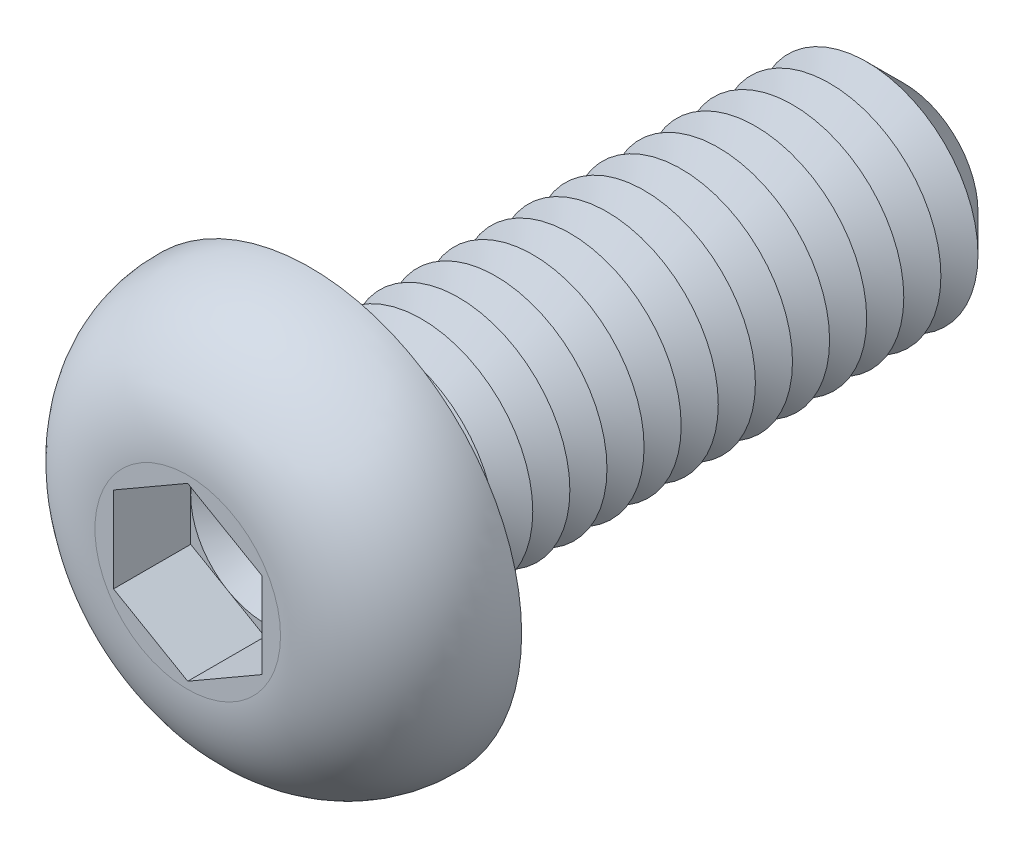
from build123d import *

# Parameters (mm, degrees)
CUT_EXTRUDE1_DEPTH  = 1.04
SKETCH4_R           = 1.5
BOSS_EXTRUDE1_DEPTH = 8
CHAMFER1_SIZE       = 0.5
LPATTERN1_COUNT     = 14
LPATTERN1_PITCH     = 0.5
FILLET2_R           = 0.2


with BuildPart() as part:
    # Sketch2 → Revolve1 (revolve)
    with BuildSketch(Plane(origin=(0, 0, 0), x_dir=(0, 0, -1), z_dir=(1, 0, 0)), mode=Mode.PRIVATE) as revolve1_sk:
        with BuildLine():
            Line((0, 0), (-1.65, 0))
            Line((-1.65, 0), (-1.65, 1.250781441))
            ThreePointArc((-1.65, 1.250781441), (-1.163552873, 2.39969397), (0, 2.85))
            Line((0, 2.85), (0, 0))
        make_face()
    revolve(revolve1_sk.sketch.rotate(Axis((0, 0, 47.934239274), (0, 0, -1)), 90), axis=Axis((0, 0, 47.934239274), (0, 0, -1)))

    # Sketch3 → Cut-Extrude1 (cut)
    with BuildSketch(Plane.XY.offset(1.65)):
        Polygon((0, 1.154700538), (-1, 0.577350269), (-1, -0.577350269), (0, -1.154700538), (1, -0.577350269), (1, 0.577350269), align=None)
    extrude(amount=-CUT_EXTRUDE1_DEPTH, mode=Mode.SUBTRACT)

    # Sketch4 → Boss-Extrude1 (add)
    with BuildSketch(Plane(origin=(0, 0, 0), x_dir=(-1, 0, 0), z_dir=(0, 0, -1))):
        with Locations(Location((0, 0, 0), (0, 0, 180))):
            Circle(SKETCH4_R)
    extrude(amount=BOSS_EXTRUDE1_DEPTH)

    # Chamfer1
    chamfer1_edges = [part.edges().sort_by_distance(p)[0] for p in [
        (-1.5, 0, -8),
    ]]
    chamfer(chamfer1_edges, length=CHAMFER1_SIZE)

    # Sketch5 → Cut-Revolve1 (revolve, cut)
    with BuildSketch(Plane(origin=(0, 0, 0), x_dir=(0, 0, -1), z_dir=(1, 0, 0)), mode=Mode.PRIVATE) as cut_revolve1_sk:
        Polygon((0.5, 1.5), (1, 1.5), (0.75, 1.066987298), align=None)
    cut_revolve1 = revolve(cut_revolve1_sk.sketch.rotate(Axis((0, 0, 47.934239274), (0, 0, -1)), 90), axis=Axis((0, 0, 47.934239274), (0, 0, -1)), mode=Mode.SUBTRACT)

    # LPattern1: Cut-Revolve1 ×14
    with Locations(*[(0, 0, -i * LPATTERN1_PITCH) for i in range(1, LPATTERN1_COUNT)]):
        add(cut_revolve1, mode=Mode.SUBTRACT)

    # Fillet2
    fillet2_edges = [part.edges().sort_by_distance(p)[0] for p in [
        (-1.5, 0, 0),
    ]]
    fillet(fillet2_edges, radius=FILLET2_R)

    # Cut-Extrude2 cone 1 section (on through the dimple's axis) → Cut-Extrude2 (revolve, cut)
    with BuildSketch(Plane(origin=(0, 0, 0.61), x_dir=(0, -1, 0), z_dir=(1, 0, 0))):
        Polygon((0, 0), (1, 0), (0, 0.577350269), align=None)
    revolve(axis=Axis((0, 0, 0.61), (0, 0, -1)), mode=Mode.SUBTRACT)


solid = part.part
